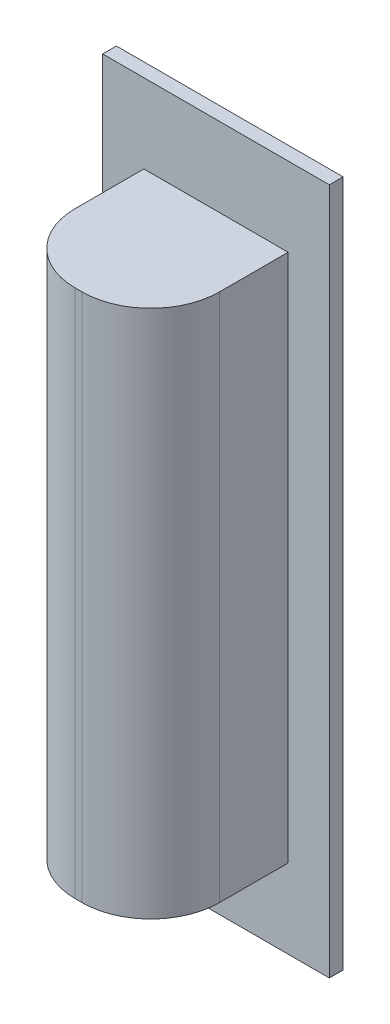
from build123d import *

# Parameters (mm, degrees)
SKETCH1_W           = 33
SKETCH1_H           = 100
BOSS_EXTRUDE1_DEPTH = 2
SKETCH4_W           = 21
SKETCH4_H           = 77
BOSS_EXTRUDE4_DEPTH = 20
FILLET2_R           = 10
SKETCH5_W           = 6
SKETCH5_H           = 6
BOSS_EXTRUDE5_DEPTH = 12
SKETCH6_R           = 3.125
BOSS_EXTRUDE6_DEPTH = 8.55


with BuildPart() as part:
    # Sketch1 → Boss-Extrude1 (new body)
    with BuildSketch(Plane.XY):
        Rectangle(SKETCH1_W, SKETCH1_H)
    extrude(amount=BOSS_EXTRUDE1_DEPTH)

    # Sketch4 → Boss-Extrude4 (add)
    with BuildSketch(Plane.XY.offset(2)):
        Rectangle(SKETCH4_W, SKETCH4_H)
    extrude(amount=BOSS_EXTRUDE4_DEPTH)

    # Fillet2
    fillet2_edges = [part.edges().sort_by_distance(p)[0] for p in [
        (10.5, 0, 22),
        (-10.5, 0, 22),
    ]]
    fillet(fillet2_edges, radius=FILLET2_R)

    # Sketch5 → Boss-Extrude5 (add)
    with BuildSketch(Plane(origin=(0, 0, 0), x_dir=(-1, 0, 0), z_dir=(0, 0, -1))):
        with Locations((8.25, -7.59)):
            Rectangle(SKETCH5_W, SKETCH5_H)
    extrude(amount=BOSS_EXTRUDE5_DEPTH)

    # Sketch6 → Boss-Extrude6 (add)
    with BuildSketch(Plane.ZY.offset(11.25)):
        with Locations(Location((-8.72354754, -7.59, 0), (0, 0, 106.260204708))):
            Circle(SKETCH6_R)
    extrude(amount=BOSS_EXTRUDE6_DEPTH)


solid = part.part
